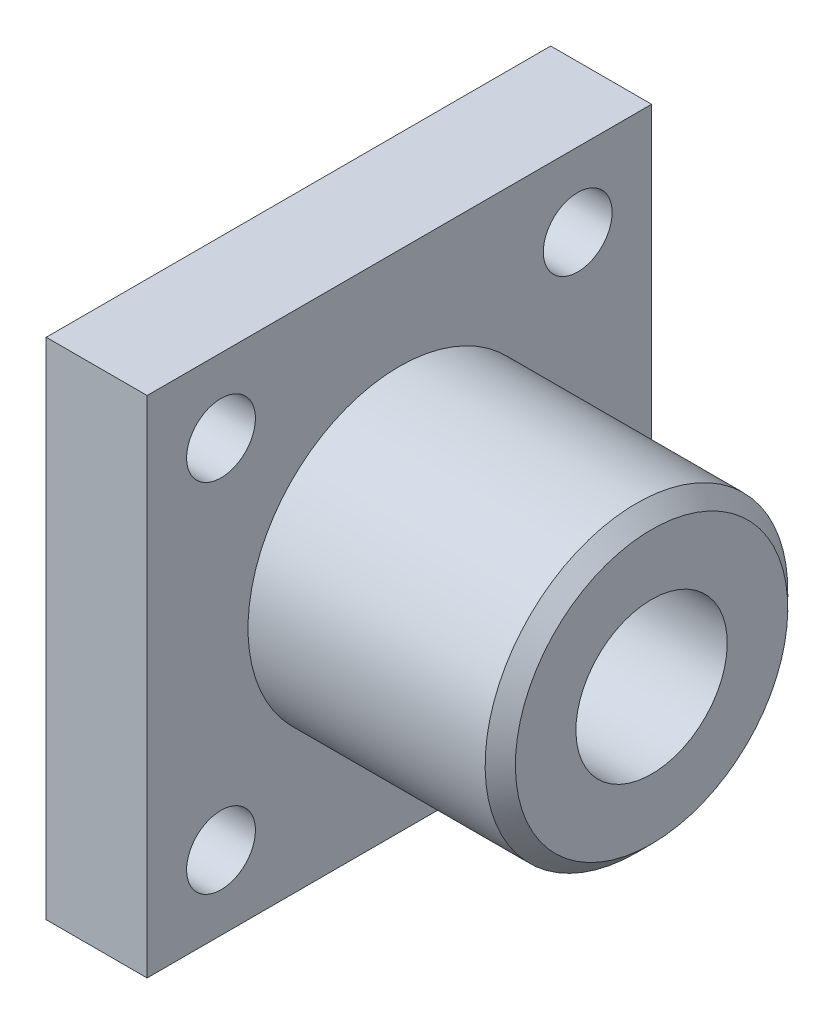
from build123d import *

# Parameters (mm, degrees)
SKETCH1_W          = 254
SKETCH1_H          = 254
EXTRUDE1_DEPTH     = 50.8
SKETCH2_R          = 17.324020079
CUT_EXTRUDE1_DEPTH = 187.6511184
SKETCH3_R          = 76.2
EXTRUDE2_DEPTH     = 127
CHAMFER1_SIZE      = 7.62
SKETCH4_R          = 38.1
CUT_EXTRUDE2_DEPTH = 253.726809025


with BuildPart() as part:
    # Sketch1 → Extrude1 (new body)
    with BuildSketch(Plane(origin=(0, 0, 0), x_dir=(0, -1, 0), z_dir=(1, 0, 0))):
        Rectangle(SKETCH1_W, SKETCH1_H)
    extrude(amount=EXTRUDE1_DEPTH)

    # Sketch2 → Cut-Extrude1 (cut, through all)
    with BuildSketch(Plane(origin=(50.8, 0, 0), x_dir=(0, -1, 0), z_dir=(1, 0, 0))):
        with Locations(Location((89.802561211, 89.802561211, 0), (0, 0, 180))):
            Circle(SKETCH2_R)
        with Locations(Location((-89.802561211, 89.802561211, 0), (0, 0, 180))):
            Circle(SKETCH2_R)
        with Locations(Location((-89.802561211, -89.802561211, 0), (0, 0, 180))):
            Circle(SKETCH2_R)
        with Locations(Location((89.802561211, -89.802561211, 0), (0, 0, 180))):
            Circle(SKETCH2_R)
    extrude(amount=-CUT_EXTRUDE1_DEPTH, mode=Mode.SUBTRACT)

    # Sketch3 → Extrude2 (add)
    with BuildSketch(Plane(origin=(50.8, 0, 0), x_dir=(0, -1, 0), z_dir=(1, 0, 0))):
        Circle(SKETCH3_R)
    extrude(amount=EXTRUDE2_DEPTH)

    # Chamfer1
    chamfer1_edges = [part.edges().sort_by_distance(p)[0] for p in [
        (177.8, 76.2, 0),
    ]]
    chamfer(chamfer1_edges, length=CHAMFER1_SIZE)

    # Sketch4 → Cut-Extrude2 (cut, through all)
    with BuildSketch(Plane(origin=(177.8, 0, 0), x_dir=(0, -1, 0), z_dir=(1, 0, 0))):
        with Locations(Location((0, 0, 0), (0, 0, 180))):
            Circle(SKETCH4_R)
    extrude(amount=-CUT_EXTRUDE2_DEPTH, mode=Mode.SUBTRACT)


solid = part.part
